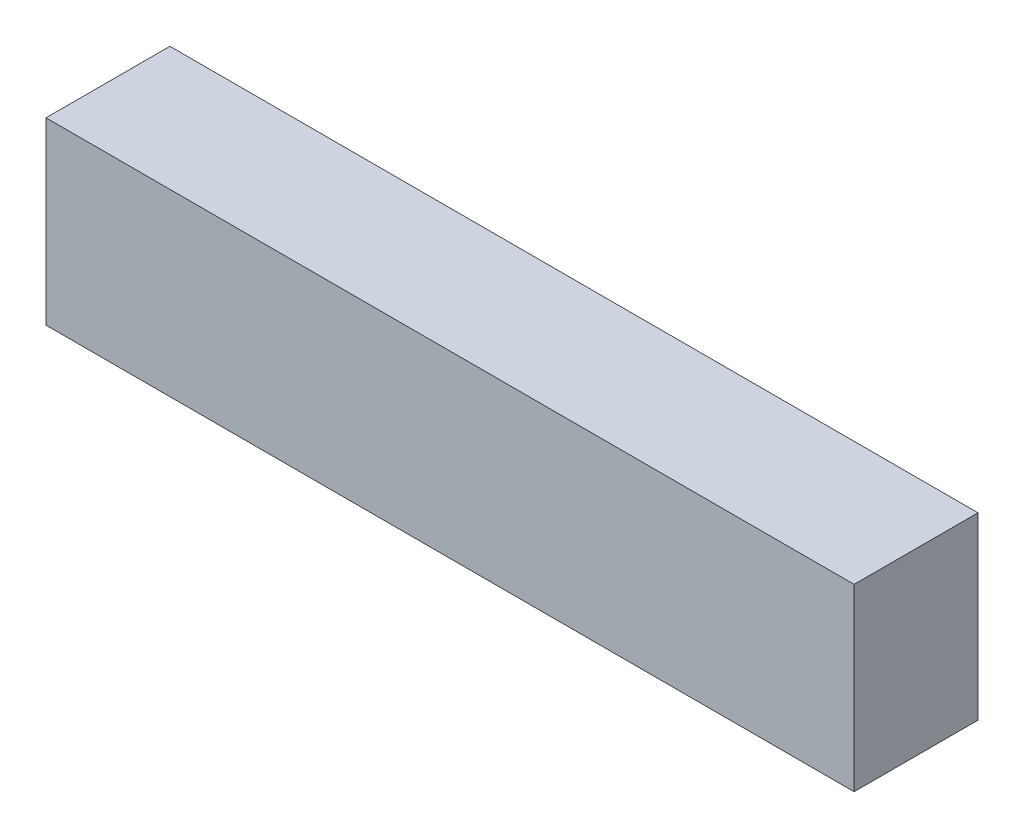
from build123d import *

# Parameters (mm, degrees)
SKETCH1_W           = 57.15
SKETCH1_H           = 12.7
BOSS_EXTRUDE1_DEPTH = 8.763


with BuildPart() as part:
    # Sketch1 → Boss-Extrude1 (new body)
    with BuildSketch(Plane.XY):
        with Locations((28.575, 6.35)):
            Rectangle(SKETCH1_W, SKETCH1_H)
    extrude(amount=BOSS_EXTRUDE1_DEPTH)


solid = part.part
